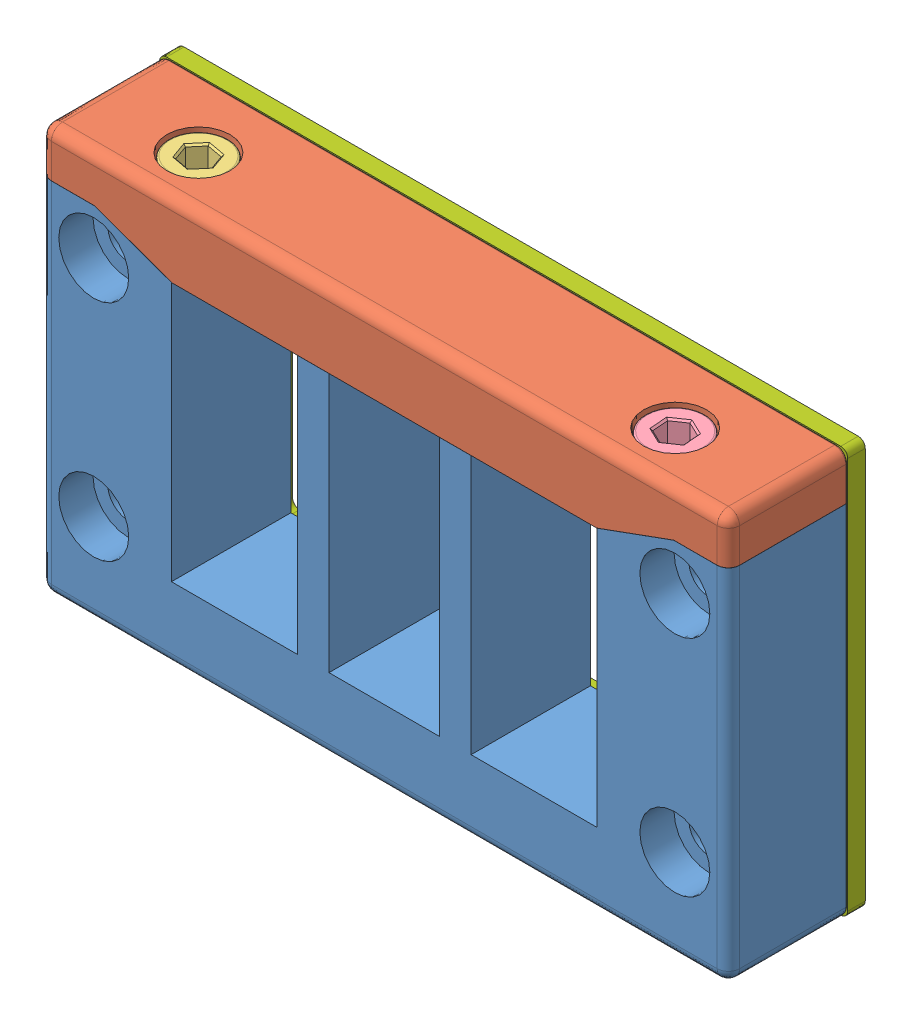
SolidWorks assembly 48216_200.SLDASM, configuration Default (file format 8000). Lengths in mm.
Overall size (98.3 58 19.55).
7 component instances, 7 part files, 0 mates.
Components (placement in the parent):
- 48216_200_01-1: 48216_200_01.SLDPRT [Default] at origin size (98.3 51.5 17.05)
- 48216_200_02-1: 48216_200_02.SLDPRT [Default] at origin size (98.3 10.49 17.05)
- 48216_200_03-1: 48216_200_03.SLDPRT [Default] at origin size (8.5 57 8.5)
- 48216_200_04-1: 48216_200_04.SLDPRT [Default] at origin size (8.5 57 8.5)
- 48216_200_05-1: 48216_200_05.SLDPRT [Default] at origin size (9.25 4.7 8.01)
- 48216_200_06-1: 48216_200_06.SLDPRT [Default] at origin size (9.25 4.7 8.01)
- 48216_200_07-1: 48216_200_07.SLDPRT [Default] at origin size (98.3 58 2.5)
